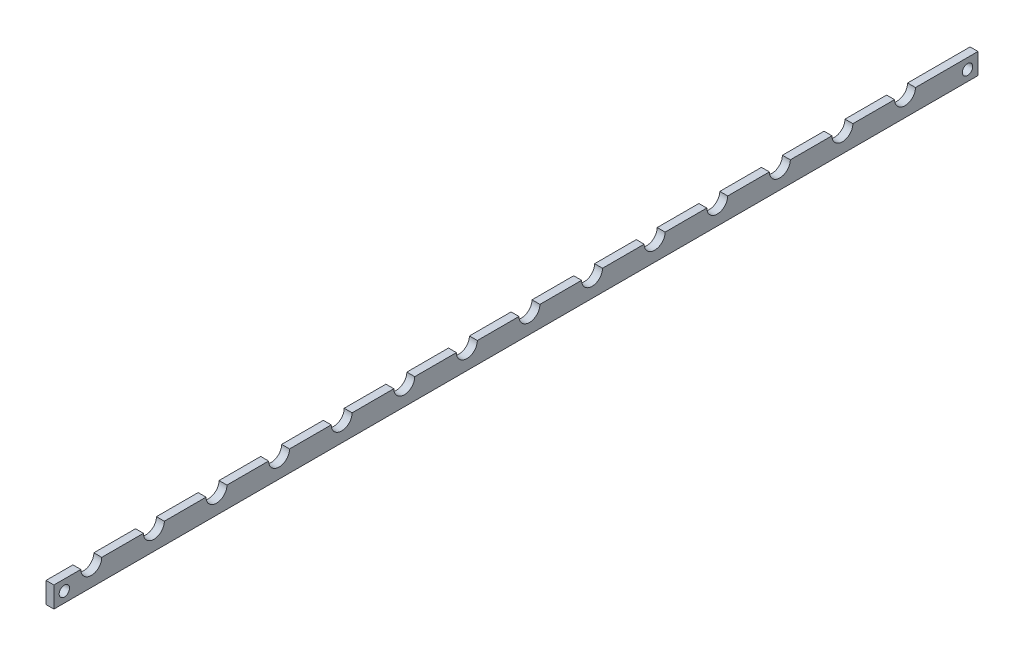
ISO-10303-21;
HEADER;
FILE_DESCRIPTION(('STEP AP214'),'2;1');
FILE_NAME('part.step','',(''),(''),'','','');
FILE_SCHEMA(('AUTOMOTIVE_DESIGN { 1 0 10303 214 1 1 1 1 }'));
ENDSEC;
DATA;
#1=APPLICATION_CONTEXT('core data for automotive mechanical design processes');
#2=APPLICATION_PROTOCOL_DEFINITION('international standard','automotive_design',2000,#1);
#3=PRODUCT_CONTEXT('',#1,'mechanical');
#4=PRODUCT('Part','Part','',(#3));
#5=PRODUCT_RELATED_PRODUCT_CATEGORY('part','',(#4));
#6=PRODUCT_DEFINITION_FORMATION('','',#4);
#7=PRODUCT_DEFINITION_CONTEXT('part definition',#1,'design');
#8=PRODUCT_DEFINITION('design','',#6,#7);
#9=PRODUCT_DEFINITION_SHAPE('','',#8);
#10=(LENGTH_UNIT() NAMED_UNIT(*) SI_UNIT(.MILLI.,.METRE.));
#11=(NAMED_UNIT(*) PLANE_ANGLE_UNIT() SI_UNIT($,.RADIAN.));
#12=(NAMED_UNIT(*) SI_UNIT($,.STERADIAN.) SOLID_ANGLE_UNIT());
#13=UNCERTAINTY_MEASURE_WITH_UNIT(LENGTH_MEASURE(1.E-05),#10,'distance_accuracy_value','');
#14=(GEOMETRIC_REPRESENTATION_CONTEXT(3) GLOBAL_UNCERTAINTY_ASSIGNED_CONTEXT((#13)) GLOBAL_UNIT_ASSIGNED_CONTEXT((#10,
#11,#12)) REPRESENTATION_CONTEXT('',''));
#15=CARTESIAN_POINT('',(0.,0.,0.));
#16=DIRECTION('',(0.,0.,1.));
#17=DIRECTION('',(1.,0.,0.));
#18=AXIS2_PLACEMENT_3D('',#15,#16,#17);
#19=CARTESIAN_POINT('',(4.8,0.,0.));
#20=DIRECTION('',(0.,-1.,0.));
#21=DIRECTION('',(0.,0.,-1.));
#22=AXIS2_PLACEMENT_3D('',#19,#20,#21);
#23=PLANE('',#22);
#24=DIRECTION('',(0.,0.,1.));
#25=VECTOR('',#24,1.);
#26=CARTESIAN_POINT('',(0.,0.,0.));
#27=LINE('',#26,#25);
#28=CARTESIAN_POINT('',(0.,0.,-54.3500000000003));
#29=VERTEX_POINT('',#28);
#30=CARTESIAN_POINT('',(0.,0.,-29.0500000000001));
#31=VERTEX_POINT('',#30);
#32=EDGE_CURVE('E261',#29,#31,#27,.T.);
#33=ORIENTED_EDGE('',*,*,#32,.T.);
#34=DIRECTION('',(1.,0.,0.));
#35=VECTOR('',#34,1.);
#36=CARTESIAN_POINT('',(0.,0.,-29.0500000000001));
#37=LINE('',#36,#35);
#38=CARTESIAN_POINT('',(4.8,0.,-29.0500000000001));
#39=VERTEX_POINT('',#38);
#40=EDGE_CURVE('E50',#31,#39,#37,.T.);
#41=ORIENTED_EDGE('',*,*,#40,.T.);
#42=DIRECTION('',(0.,0.,1.));
#43=VECTOR('',#42,1.);
#44=CARTESIAN_POINT('',(4.8,0.,0.));
#45=LINE('',#44,#43);
#46=CARTESIAN_POINT('',(4.8,0.,-54.3500000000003));
#47=VERTEX_POINT('',#46);
#48=EDGE_CURVE('E411',#47,#39,#45,.T.);
#49=ORIENTED_EDGE('',*,*,#48,.F.);
#50=DIRECTION('',(1.,0.,0.));
#51=VECTOR('',#50,1.);
#52=CARTESIAN_POINT('',(0.,0.,-54.3500000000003));
#53=LINE('',#52,#51);
#54=EDGE_CURVE('E491',#47,#29,#53,.F.);
#55=ORIENTED_EDGE('',*,*,#54,.T.);
#56=EDGE_LOOP('',(#33,#41,#49,#55));
#57=FACE_BOUND('',#56,.T.);
#58=ADVANCED_FACE('F35',(#57),#23,.F.);
#59=CARTESIAN_POINT('',(0.,0.,-92.3500000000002));
#60=VERTEX_POINT('',#59);
#61=CARTESIAN_POINT('',(0.,0.,-67.0500000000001));
#62=VERTEX_POINT('',#61);
#63=EDGE_CURVE('E265',#60,#62,#27,.T.);
#64=ORIENTED_EDGE('',*,*,#63,.T.);
#65=DIRECTION('',(1.,0.,0.));
#66=VECTOR('',#65,1.);
#67=CARTESIAN_POINT('',(0.,0.,-67.0500000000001));
#68=LINE('',#67,#66);
#69=CARTESIAN_POINT('',(4.8,0.,-67.0500000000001));
#70=VERTEX_POINT('',#69);
#71=EDGE_CURVE('E57',#62,#70,#68,.T.);
#72=ORIENTED_EDGE('',*,*,#71,.T.);
#73=CARTESIAN_POINT('',(4.8,0.,-92.3500000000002));
#74=VERTEX_POINT('',#73);
#75=EDGE_CURVE('E414',#74,#70,#45,.T.);
#76=ORIENTED_EDGE('',*,*,#75,.F.);
#77=DIRECTION('',(1.,0.,0.));
#78=VECTOR('',#77,1.);
#79=CARTESIAN_POINT('',(0.,0.,-92.3500000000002));
#80=LINE('',#79,#78);
#81=EDGE_CURVE('E351',#74,#60,#80,.F.);
#82=ORIENTED_EDGE('',*,*,#81,.T.);
#83=EDGE_LOOP('',(#64,#72,#76,#82));
#84=FACE_BOUND('',#83,.T.);
#85=ADVANCED_FACE('F348',(#84),#23,.F.);
#86=CARTESIAN_POINT('',(0.,0.,-130.35));
#87=VERTEX_POINT('',#86);
#88=CARTESIAN_POINT('',(0.,0.,-105.05));
#89=VERTEX_POINT('',#88);
#90=EDGE_CURVE('E334',#87,#89,#27,.T.);
#91=ORIENTED_EDGE('',*,*,#90,.T.);
#92=DIRECTION('',(1.,0.,0.));
#93=VECTOR('',#92,1.);
#94=CARTESIAN_POINT('',(0.,0.,-105.05));
#95=LINE('',#94,#93);
#96=CARTESIAN_POINT('',(4.8,0.,-105.05));
#97=VERTEX_POINT('',#96);
#98=EDGE_CURVE('E485',#89,#97,#95,.T.);
#99=ORIENTED_EDGE('',*,*,#98,.T.);
#100=CARTESIAN_POINT('',(4.8,0.,-130.35));
#101=VERTEX_POINT('',#100);
#102=EDGE_CURVE('E530',#101,#97,#45,.T.);
#103=ORIENTED_EDGE('',*,*,#102,.F.);
#104=DIRECTION('',(1.,0.,0.));
#105=VECTOR('',#104,1.);
#106=CARTESIAN_POINT('',(0.,0.,-130.35));
#107=LINE('',#106,#105);
#108=EDGE_CURVE('E481',#101,#87,#107,.F.);
#109=ORIENTED_EDGE('',*,*,#108,.T.);
#110=EDGE_LOOP('',(#91,#99,#103,#109));
#111=FACE_BOUND('',#110,.T.);
#112=ADVANCED_FACE('F591',(#111),#23,.F.);
#113=CARTESIAN_POINT('',(0.,0.,-168.35));
#114=VERTEX_POINT('',#113);
#115=CARTESIAN_POINT('',(0.,0.,-143.05));
#116=VERTEX_POINT('',#115);
#117=EDGE_CURVE('E328',#114,#116,#27,.T.);
#118=ORIENTED_EDGE('',*,*,#117,.T.);
#119=DIRECTION('',(1.,0.,0.));
#120=VECTOR('',#119,1.);
#121=CARTESIAN_POINT('',(0.,0.,-143.05));
#122=LINE('',#121,#120);
#123=CARTESIAN_POINT('',(4.8,0.,-143.05));
#124=VERTEX_POINT('',#123);
#125=EDGE_CURVE('E479',#116,#124,#122,.T.);
#126=ORIENTED_EDGE('',*,*,#125,.T.);
#127=CARTESIAN_POINT('',(4.8,0.,-168.35));
#128=VERTEX_POINT('',#127);
#129=EDGE_CURVE('E531',#128,#124,#45,.T.);
#130=ORIENTED_EDGE('',*,*,#129,.F.);
#131=DIRECTION('',(1.,0.,0.));
#132=VECTOR('',#131,1.);
#133=CARTESIAN_POINT('',(0.,0.,-168.35));
#134=LINE('',#133,#132);
#135=EDGE_CURVE('E475',#128,#114,#134,.F.);
#136=ORIENTED_EDGE('',*,*,#135,.T.);
#137=EDGE_LOOP('',(#118,#126,#130,#136));
#138=FACE_BOUND('',#137,.T.);
#139=ADVANCED_FACE('F588',(#138),#23,.F.);
#140=CARTESIAN_POINT('',(0.,0.,-206.35));
#141=VERTEX_POINT('',#140);
#142=CARTESIAN_POINT('',(0.,0.,-181.05));
#143=VERTEX_POINT('',#142);
#144=EDGE_CURVE('E322',#141,#143,#27,.T.);
#145=ORIENTED_EDGE('',*,*,#144,.T.);
#146=DIRECTION('',(1.,0.,0.));
#147=VECTOR('',#146,1.);
#148=CARTESIAN_POINT('',(0.,0.,-181.05));
#149=LINE('',#148,#147);
#150=CARTESIAN_POINT('',(4.8,0.,-181.05));
#151=VERTEX_POINT('',#150);
#152=EDGE_CURVE('E473',#143,#151,#149,.T.);
#153=ORIENTED_EDGE('',*,*,#152,.T.);
#154=CARTESIAN_POINT('',(4.8,0.,-206.35));
#155=VERTEX_POINT('',#154);
#156=EDGE_CURVE('E535',#155,#151,#45,.T.);
#157=ORIENTED_EDGE('',*,*,#156,.F.);
#158=DIRECTION('',(1.,0.,0.));
#159=VECTOR('',#158,1.);
#160=CARTESIAN_POINT('',(0.,0.,-206.35));
#161=LINE('',#160,#159);
#162=EDGE_CURVE('E469',#155,#141,#161,.F.);
#163=ORIENTED_EDGE('',*,*,#162,.T.);
#164=EDGE_LOOP('',(#145,#153,#157,#163));
#165=FACE_BOUND('',#164,.T.);
#166=ADVANCED_FACE('F647',(#165),#23,.F.);
#167=CARTESIAN_POINT('',(0.,0.,-244.35));
#168=VERTEX_POINT('',#167);
#169=CARTESIAN_POINT('',(0.,0.,-219.05));
#170=VERTEX_POINT('',#169);
#171=EDGE_CURVE('E316',#168,#170,#27,.T.);
#172=ORIENTED_EDGE('',*,*,#171,.T.);
#173=DIRECTION('',(1.,0.,0.));
#174=VECTOR('',#173,1.);
#175=CARTESIAN_POINT('',(0.,0.,-219.05));
#176=LINE('',#175,#174);
#177=CARTESIAN_POINT('',(4.8,0.,-219.05));
#178=VERTEX_POINT('',#177);
#179=EDGE_CURVE('E467',#170,#178,#176,.T.);
#180=ORIENTED_EDGE('',*,*,#179,.T.);
#181=CARTESIAN_POINT('',(4.8,0.,-244.35));
#182=VERTEX_POINT('',#181);
#183=EDGE_CURVE('E539',#182,#178,#45,.T.);
#184=ORIENTED_EDGE('',*,*,#183,.F.);
#185=DIRECTION('',(1.,0.,0.));
#186=VECTOR('',#185,1.);
#187=CARTESIAN_POINT('',(0.,0.,-244.35));
#188=LINE('',#187,#186);
#189=EDGE_CURVE('E463',#182,#168,#188,.F.);
#190=ORIENTED_EDGE('',*,*,#189,.T.);
#191=EDGE_LOOP('',(#172,#180,#184,#190));
#192=FACE_BOUND('',#191,.T.);
#193=ADVANCED_FACE('F583',(#192),#23,.F.);
#194=CARTESIAN_POINT('',(0.,0.,-282.35));
#195=VERTEX_POINT('',#194);
#196=CARTESIAN_POINT('',(0.,0.,-257.05));
#197=VERTEX_POINT('',#196);
#198=EDGE_CURVE('E310',#195,#197,#27,.T.);
#199=ORIENTED_EDGE('',*,*,#198,.T.);
#200=DIRECTION('',(1.,0.,0.));
#201=VECTOR('',#200,1.);
#202=CARTESIAN_POINT('',(0.,0.,-257.05));
#203=LINE('',#202,#201);
#204=CARTESIAN_POINT('',(4.8,0.,-257.05));
#205=VERTEX_POINT('',#204);
#206=EDGE_CURVE('E461',#197,#205,#203,.T.);
#207=ORIENTED_EDGE('',*,*,#206,.T.);
#208=CARTESIAN_POINT('',(4.8,0.,-282.35));
#209=VERTEX_POINT('',#208);
#210=EDGE_CURVE('E543',#209,#205,#45,.T.);
#211=ORIENTED_EDGE('',*,*,#210,.F.);
#212=DIRECTION('',(1.,0.,0.));
#213=VECTOR('',#212,1.);
#214=CARTESIAN_POINT('',(0.,0.,-282.35));
#215=LINE('',#214,#213);
#216=EDGE_CURVE('E457',#209,#195,#215,.F.);
#217=ORIENTED_EDGE('',*,*,#216,.T.);
#218=EDGE_LOOP('',(#199,#207,#211,#217));
#219=FACE_BOUND('',#218,.T.);
#220=ADVANCED_FACE('F640',(#219),#23,.F.);
#221=CARTESIAN_POINT('',(0.,0.,-320.35));
#222=VERTEX_POINT('',#221);
#223=CARTESIAN_POINT('',(0.,0.,-295.05));
#224=VERTEX_POINT('',#223);
#225=EDGE_CURVE('E304',#222,#224,#27,.T.);
#226=ORIENTED_EDGE('',*,*,#225,.T.);
#227=DIRECTION('',(1.,0.,0.));
#228=VECTOR('',#227,1.);
#229=CARTESIAN_POINT('',(0.,0.,-295.05));
#230=LINE('',#229,#228);
#231=CARTESIAN_POINT('',(4.8,0.,-295.05));
#232=VERTEX_POINT('',#231);
#233=EDGE_CURVE('E455',#224,#232,#230,.T.);
#234=ORIENTED_EDGE('',*,*,#233,.T.);
#235=CARTESIAN_POINT('',(4.8,0.,-320.35));
#236=VERTEX_POINT('',#235);
#237=EDGE_CURVE('E547',#236,#232,#45,.T.);
#238=ORIENTED_EDGE('',*,*,#237,.F.);
#239=DIRECTION('',(1.,0.,0.));
#240=VECTOR('',#239,1.);
#241=CARTESIAN_POINT('',(0.,0.,-320.35));
#242=LINE('',#241,#240);
#243=EDGE_CURVE('E451',#236,#222,#242,.F.);
#244=ORIENTED_EDGE('',*,*,#243,.T.);
#245=EDGE_LOOP('',(#226,#234,#238,#244));
#246=FACE_BOUND('',#245,.T.);
#247=ADVANCED_FACE('F578',(#246),#23,.F.);
#248=CARTESIAN_POINT('',(0.,0.,-358.35));
#249=VERTEX_POINT('',#248);
#250=CARTESIAN_POINT('',(0.,0.,-333.05));
#251=VERTEX_POINT('',#250);
#252=EDGE_CURVE('E298',#249,#251,#27,.T.);
#253=ORIENTED_EDGE('',*,*,#252,.T.);
#254=DIRECTION('',(1.,0.,0.));
#255=VECTOR('',#254,1.);
#256=CARTESIAN_POINT('',(0.,0.,-333.05));
#257=LINE('',#256,#255);
#258=CARTESIAN_POINT('',(4.8,0.,-333.05));
#259=VERTEX_POINT('',#258);
#260=EDGE_CURVE('E449',#251,#259,#257,.T.);
#261=ORIENTED_EDGE('',*,*,#260,.T.);
#262=CARTESIAN_POINT('',(4.8,0.,-358.35));
#263=VERTEX_POINT('',#262);
#264=EDGE_CURVE('E551',#263,#259,#45,.T.);
#265=ORIENTED_EDGE('',*,*,#264,.F.);
#266=DIRECTION('',(1.,0.,0.));
#267=VECTOR('',#266,1.);
#268=CARTESIAN_POINT('',(0.,0.,-358.35));
#269=LINE('',#268,#267);
#270=EDGE_CURVE('E445',#263,#249,#269,.F.);
#271=ORIENTED_EDGE('',*,*,#270,.T.);
#272=EDGE_LOOP('',(#253,#261,#265,#271));
#273=FACE_BOUND('',#272,.T.);
#274=ADVANCED_FACE('F633',(#273),#23,.F.);
#275=CARTESIAN_POINT('',(0.,0.,-396.35));
#276=VERTEX_POINT('',#275);
#277=CARTESIAN_POINT('',(0.,0.,-371.05));
#278=VERTEX_POINT('',#277);
#279=EDGE_CURVE('E292',#276,#278,#27,.T.);
#280=ORIENTED_EDGE('',*,*,#279,.T.);
#281=DIRECTION('',(1.,0.,0.));
#282=VECTOR('',#281,1.);
#283=CARTESIAN_POINT('',(0.,0.,-371.05));
#284=LINE('',#283,#282);
#285=CARTESIAN_POINT('',(4.8,0.,-371.05));
#286=VERTEX_POINT('',#285);
#287=EDGE_CURVE('E443',#278,#286,#284,.T.);
#288=ORIENTED_EDGE('',*,*,#287,.T.);
#289=CARTESIAN_POINT('',(4.8,0.,-396.35));
#290=VERTEX_POINT('',#289);
#291=EDGE_CURVE('E555',#290,#286,#45,.T.);
#292=ORIENTED_EDGE('',*,*,#291,.F.);
#293=DIRECTION('',(1.,0.,0.));
#294=VECTOR('',#293,1.);
#295=CARTESIAN_POINT('',(0.,0.,-396.35));
#296=LINE('',#295,#294);
#297=EDGE_CURVE('E439',#290,#276,#296,.F.);
#298=ORIENTED_EDGE('',*,*,#297,.T.);
#299=EDGE_LOOP('',(#280,#288,#292,#298));
#300=FACE_BOUND('',#299,.T.);
#301=ADVANCED_FACE('F573',(#300),#23,.F.);
#302=CARTESIAN_POINT('',(0.,0.,-434.35));
#303=VERTEX_POINT('',#302);
#304=CARTESIAN_POINT('',(0.,0.,-409.05));
#305=VERTEX_POINT('',#304);
#306=EDGE_CURVE('E286',#303,#305,#27,.T.);
#307=ORIENTED_EDGE('',*,*,#306,.T.);
#308=DIRECTION('',(1.,0.,0.));
#309=VECTOR('',#308,1.);
#310=CARTESIAN_POINT('',(0.,0.,-409.05));
#311=LINE('',#310,#309);
#312=CARTESIAN_POINT('',(4.8,0.,-409.05));
#313=VERTEX_POINT('',#312);
#314=EDGE_CURVE('E437',#305,#313,#311,.T.);
#315=ORIENTED_EDGE('',*,*,#314,.T.);
#316=CARTESIAN_POINT('',(4.8,0.,-434.35));
#317=VERTEX_POINT('',#316);
#318=EDGE_CURVE('E559',#317,#313,#45,.T.);
#319=ORIENTED_EDGE('',*,*,#318,.F.);
#320=DIRECTION('',(1.,0.,0.));
#321=VECTOR('',#320,1.);
#322=CARTESIAN_POINT('',(0.,0.,-434.35));
#323=LINE('',#322,#321);
#324=EDGE_CURVE('E433',#317,#303,#323,.F.);
#325=ORIENTED_EDGE('',*,*,#324,.T.);
#326=EDGE_LOOP('',(#307,#315,#319,#325));
#327=FACE_BOUND('',#326,.T.);
#328=ADVANCED_FACE('F626',(#327),#23,.F.);
#329=CARTESIAN_POINT('',(0.,0.,-472.35));
#330=VERTEX_POINT('',#329);
#331=CARTESIAN_POINT('',(0.,0.,-447.05));
#332=VERTEX_POINT('',#331);
#333=EDGE_CURVE('E280',#330,#332,#27,.T.);
#334=ORIENTED_EDGE('',*,*,#333,.T.);
#335=DIRECTION('',(1.,0.,0.));
#336=VECTOR('',#335,1.);
#337=CARTESIAN_POINT('',(0.,0.,-447.05));
#338=LINE('',#337,#336);
#339=CARTESIAN_POINT('',(4.8,0.,-447.05));
#340=VERTEX_POINT('',#339);
#341=EDGE_CURVE('E431',#332,#340,#338,.T.);
#342=ORIENTED_EDGE('',*,*,#341,.T.);
#343=CARTESIAN_POINT('',(4.8,0.,-472.35));
#344=VERTEX_POINT('',#343);
#345=EDGE_CURVE('E408',#344,#340,#45,.T.);
#346=ORIENTED_EDGE('',*,*,#345,.F.);
#347=DIRECTION('',(1.,0.,0.));
#348=VECTOR('',#347,1.);
#349=CARTESIAN_POINT('',(0.,0.,-472.35));
#350=LINE('',#349,#348);
#351=EDGE_CURVE('E427',#344,#330,#350,.F.);
#352=ORIENTED_EDGE('',*,*,#351,.T.);
#353=EDGE_LOOP('',(#334,#342,#346,#352));
#354=FACE_BOUND('',#353,.T.);
#355=ADVANCED_FACE('F568',(#354),#23,.F.);
#356=CARTESIAN_POINT('',(0.,0.,-510.35));
#357=VERTEX_POINT('',#356);
#358=CARTESIAN_POINT('',(0.,0.,-485.05));
#359=VERTEX_POINT('',#358);
#360=EDGE_CURVE('E271',#357,#359,#27,.T.);
#361=ORIENTED_EDGE('',*,*,#360,.T.);
#362=DIRECTION('',(1.,0.,0.));
#363=VECTOR('',#362,1.);
#364=CARTESIAN_POINT('',(0.,0.,-485.05));
#365=LINE('',#364,#363);
#366=CARTESIAN_POINT('',(4.8,0.,-485.05));
#367=VERTEX_POINT('',#366);
#368=EDGE_CURVE('E425',#359,#367,#365,.T.);
#369=ORIENTED_EDGE('',*,*,#368,.T.);
#370=CARTESIAN_POINT('',(4.8,0.,-510.35));
#371=VERTEX_POINT('',#370);
#372=EDGE_CURVE('E402',#371,#367,#45,.T.);
#373=ORIENTED_EDGE('',*,*,#372,.F.);
#374=DIRECTION('',(1.,0.,0.));
#375=VECTOR('',#374,1.);
#376=CARTESIAN_POINT('',(0.,0.,-510.35));
#377=LINE('',#376,#375);
#378=EDGE_CURVE('E421',#371,#357,#377,.F.);
#379=ORIENTED_EDGE('',*,*,#378,.T.);
#380=EDGE_LOOP('',(#361,#369,#373,#379));
#381=FACE_BOUND('',#380,.T.);
#382=ADVANCED_FACE('F618',(#381),#23,.F.);
#383=CARTESIAN_POINT('',(0.,0.,-561.));
#384=VERTEX_POINT('',#383);
#385=CARTESIAN_POINT('',(0.,0.,-523.05));
#386=VERTEX_POINT('',#385);
#387=EDGE_CURVE('E264',#384,#386,#27,.T.);
#388=ORIENTED_EDGE('',*,*,#387,.T.);
#389=DIRECTION('',(1.,0.,0.));
#390=VECTOR('',#389,1.);
#391=CARTESIAN_POINT('',(0.,0.,-523.05));
#392=LINE('',#391,#390);
#393=CARTESIAN_POINT('',(4.8,0.,-523.05));
#394=VERTEX_POINT('',#393);
#395=EDGE_CURVE('E419',#386,#394,#392,.T.);
#396=ORIENTED_EDGE('',*,*,#395,.T.);
#397=CARTESIAN_POINT('',(4.8,0.,-561.));
#398=VERTEX_POINT('',#397);
#399=EDGE_CURVE('E398',#398,#394,#45,.T.);
#400=ORIENTED_EDGE('',*,*,#399,.F.);
#401=DIRECTION('',(-1.,0.,0.));
#402=VECTOR('',#401,1.);
#403=CARTESIAN_POINT('',(4.8,0.,-561.));
#404=LINE('',#403,#402);
#405=EDGE_CURVE('E396',#398,#384,#404,.T.);
#406=ORIENTED_EDGE('',*,*,#405,.T.);
#407=EDGE_LOOP('',(#388,#396,#400,#406));
#408=FACE_BOUND('',#407,.T.);
#409=ADVANCED_FACE('F611',(#408),#23,.F.);
#410=CARTESIAN_POINT('',(4.8,0.,0.));
#411=DIRECTION('',(0.,0.,-1.));
#412=DIRECTION('',(0.,1.,0.));
#413=AXIS2_PLACEMENT_3D('',#410,#411,#412);
#414=PLANE('',#413);
#415=DIRECTION('',(0.,-1.,0.));
#416=VECTOR('',#415,1.);
#417=CARTESIAN_POINT('',(0.,0.,0.));
#418=LINE('',#417,#416);
#419=CARTESIAN_POINT('',(0.,0.,0.));
#420=VERTEX_POINT('',#419);
#421=CARTESIAN_POINT('',(0.,-12.7,0.));
#422=VERTEX_POINT('',#421);
#423=EDGE_CURVE('E260',#420,#422,#418,.T.);
#424=ORIENTED_EDGE('',*,*,#423,.T.);
#425=DIRECTION('',(-1.,0.,0.));
#426=VECTOR('',#425,1.);
#427=CARTESIAN_POINT('',(4.8,-12.7,0.));
#428=LINE('',#427,#426);
#429=CARTESIAN_POINT('',(4.8,-12.7,0.));
#430=VERTEX_POINT('',#429);
#431=EDGE_CURVE('E390',#430,#422,#428,.T.);
#432=ORIENTED_EDGE('',*,*,#431,.F.);
#433=DIRECTION('',(0.,-1.,0.));
#434=VECTOR('',#433,1.);
#435=CARTESIAN_POINT('',(4.8,0.,0.));
#436=LINE('',#435,#434);
#437=CARTESIAN_POINT('',(4.8,0.,0.));
#438=VERTEX_POINT('',#437);
#439=EDGE_CURVE('E270',#438,#430,#436,.T.);
#440=ORIENTED_EDGE('',*,*,#439,.F.);
#441=DIRECTION('',(-1.,0.,0.));
#442=VECTOR('',#441,1.);
#443=CARTESIAN_POINT('',(4.8,0.,0.));
#444=LINE('',#443,#442);
#445=EDGE_CURVE('E397',#438,#420,#444,.T.);
#446=ORIENTED_EDGE('',*,*,#445,.T.);
#447=EDGE_LOOP('',(#424,#432,#440,#446));
#448=FACE_BOUND('',#447,.T.);
#449=ADVANCED_FACE('F37',(#448),#414,.F.);
#450=CARTESIAN_POINT('',(4.8,-12.7,0.));
#451=DIRECTION('',(0.,1.,0.));
#452=DIRECTION('',(0.,0.,1.));
#453=AXIS2_PLACEMENT_3D('',#450,#451,#452);
#454=PLANE('',#453);
#455=DIRECTION('',(0.,0.,-1.));
#456=VECTOR('',#455,1.);
#457=CARTESIAN_POINT('',(0.,-12.7,0.));
#458=LINE('',#457,#456);
#459=CARTESIAN_POINT('',(0.,-12.7,-561.));
#460=VERTEX_POINT('',#459);
#461=EDGE_CURVE('E266',#422,#460,#458,.T.);
#462=ORIENTED_EDGE('',*,*,#461,.T.);
#463=DIRECTION('',(-1.,0.,0.));
#464=VECTOR('',#463,1.);
#465=CARTESIAN_POINT('',(4.8,-12.7,-561.));
#466=LINE('',#465,#464);
#467=CARTESIAN_POINT('',(4.8,-12.7,-561.));
#468=VERTEX_POINT('',#467);
#469=EDGE_CURVE('E393',#468,#460,#466,.T.);
#470=ORIENTED_EDGE('',*,*,#469,.F.);
#471=DIRECTION('',(0.,0.,-1.));
#472=VECTOR('',#471,1.);
#473=CARTESIAN_POINT('',(4.8,-12.7,0.));
#474=LINE('',#473,#472);
#475=EDGE_CURVE('E277',#430,#468,#474,.T.);
#476=ORIENTED_EDGE('',*,*,#475,.F.);
#477=ORIENTED_EDGE('',*,*,#431,.T.);
#478=EDGE_LOOP('',(#462,#470,#476,#477));
#479=FACE_BOUND('',#478,.T.);
#480=ADVANCED_FACE('F615',(#479),#454,.F.);
#481=CARTESIAN_POINT('',(4.8,0.,-561.));
#482=DIRECTION('',(0.,0.,1.));
#483=DIRECTION('',(0.,-1.,0.));
#484=AXIS2_PLACEMENT_3D('',#481,#482,#483);
#485=PLANE('',#484);
#486=DIRECTION('',(0.,1.,0.));
#487=VECTOR('',#486,1.);
#488=CARTESIAN_POINT('',(0.,0.,-561.));
#489=LINE('',#488,#487);
#490=EDGE_CURVE('E262',#460,#384,#489,.T.);
#491=ORIENTED_EDGE('',*,*,#490,.T.);
#492=ORIENTED_EDGE('',*,*,#405,.F.);
#493=DIRECTION('',(0.,1.,0.));
#494=VECTOR('',#493,1.);
#495=CARTESIAN_POINT('',(4.8,0.,-561.));
#496=LINE('',#495,#494);
#497=EDGE_CURVE('E412',#468,#398,#496,.T.);
#498=ORIENTED_EDGE('',*,*,#497,.F.);
#499=ORIENTED_EDGE('',*,*,#469,.T.);
#500=EDGE_LOOP('',(#491,#492,#498,#499));
#501=FACE_BOUND('',#500,.T.);
#502=ADVANCED_FACE('F610',(#501),#485,.F.);
#503=CARTESIAN_POINT('',(4.8,0.,-16.3500000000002));
#504=VERTEX_POINT('',#503);
#505=EDGE_CURVE('E254',#504,#438,#45,.T.);
#506=ORIENTED_EDGE('',*,*,#505,.F.);
#507=DIRECTION('',(1.,0.,0.));
#508=VECTOR('',#507,1.);
#509=CARTESIAN_POINT('',(0.,0.,-16.3500000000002));
#510=LINE('',#509,#508);
#511=CARTESIAN_POINT('',(0.,0.,-16.3500000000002));
#512=VERTEX_POINT('',#511);
#513=EDGE_CURVE('E242',#504,#512,#510,.F.);
#514=ORIENTED_EDGE('',*,*,#513,.T.);
#515=EDGE_CURVE('E252',#512,#420,#27,.T.);
#516=ORIENTED_EDGE('',*,*,#515,.T.);
#517=ORIENTED_EDGE('',*,*,#445,.F.);
#518=EDGE_LOOP('',(#506,#514,#516,#517));
#519=FACE_BOUND('',#518,.T.);
#520=ADVANCED_FACE('F250',(#519),#23,.F.);
#521=CARTESIAN_POINT('',(4.8,-12.7,0.));
#522=DIRECTION('',(1.,0.,0.));
#523=DIRECTION('',(0.,0.,-1.));
#524=AXIS2_PLACEMENT_3D('',#521,#522,#523);
#525=PLANE('',#524);
#526=CARTESIAN_POINT('',(4.8,-6.35,-6.35));
#527=DIRECTION('',(1.,0.,0.));
#528=DIRECTION('',(0.,0.,-1.));
#529=AXIS2_PLACEMENT_3D('',#526,#527,#528);
#530=CIRCLE('',#529,3.15);
#531=CARTESIAN_POINT('',(4.8,-6.35,-9.5));
#532=VERTEX_POINT('',#531);
#533=EDGE_CURVE('E504',#532,#532,#530,.T.);
#534=ORIENTED_EDGE('',*,*,#533,.F.);
#535=EDGE_LOOP('',(#534));
#536=FACE_BOUND('',#535,.T.);
#537=CARTESIAN_POINT('',(4.8,-6.35,-554.65));
#538=DIRECTION('',(1.,0.,0.));
#539=DIRECTION('',(0.,0.,-1.));
#540=AXIS2_PLACEMENT_3D('',#537,#538,#539);
#541=CIRCLE('',#540,3.15000000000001);
#542=CARTESIAN_POINT('',(4.8,-6.35,-557.8));
#543=VERTEX_POINT('',#542);
#544=EDGE_CURVE('E498',#543,#543,#541,.T.);
#545=ORIENTED_EDGE('',*,*,#544,.F.);
#546=EDGE_LOOP('',(#545));
#547=FACE_BOUND('',#546,.T.);
#548=CARTESIAN_POINT('',(4.8,0.,-22.7000000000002));
#549=DIRECTION('',(1.,0.,0.));
#550=DIRECTION('',(0.,0.,-1.));
#551=AXIS2_PLACEMENT_3D('',#548,#549,#550);
#552=CIRCLE('',#551,6.34999999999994);
#553=EDGE_CURVE('E255',#504,#39,#552,.T.);
#554=ORIENTED_EDGE('',*,*,#553,.F.);
#555=ORIENTED_EDGE('',*,*,#505,.T.);
#556=ORIENTED_EDGE('',*,*,#439,.T.);
#557=ORIENTED_EDGE('',*,*,#475,.T.);
#558=ORIENTED_EDGE('',*,*,#497,.T.);
#559=ORIENTED_EDGE('',*,*,#399,.T.);
#560=CARTESIAN_POINT('',(4.8,0.,-516.7));
#561=DIRECTION('',(1.,0.,0.));
#562=DIRECTION('',(0.,0.,-1.));
#563=AXIS2_PLACEMENT_3D('',#560,#561,#562);
#564=CIRCLE('',#563,6.34999999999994);
#565=EDGE_CURVE('E423',#371,#394,#564,.T.);
#566=ORIENTED_EDGE('',*,*,#565,.F.);
#567=ORIENTED_EDGE('',*,*,#372,.T.);
#568=CARTESIAN_POINT('',(4.8,0.,-478.7));
#569=DIRECTION('',(1.,0.,0.));
#570=DIRECTION('',(0.,0.,-1.));
#571=AXIS2_PLACEMENT_3D('',#568,#569,#570);
#572=CIRCLE('',#571,6.34999999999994);
#573=EDGE_CURVE('E429',#344,#367,#572,.T.);
#574=ORIENTED_EDGE('',*,*,#573,.F.);
#575=ORIENTED_EDGE('',*,*,#345,.T.);
#576=CARTESIAN_POINT('',(4.8,0.,-440.7));
#577=DIRECTION('',(1.,0.,0.));
#578=DIRECTION('',(0.,0.,-1.));
#579=AXIS2_PLACEMENT_3D('',#576,#577,#578);
#580=CIRCLE('',#579,6.34999999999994);
#581=EDGE_CURVE('E435',#317,#340,#580,.T.);
#582=ORIENTED_EDGE('',*,*,#581,.F.);
#583=ORIENTED_EDGE('',*,*,#318,.T.);
#584=CARTESIAN_POINT('',(4.8,0.,-402.7));
#585=DIRECTION('',(1.,0.,0.));
#586=DIRECTION('',(0.,0.,-1.));
#587=AXIS2_PLACEMENT_3D('',#584,#585,#586);
#588=CIRCLE('',#587,6.34999999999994);
#589=EDGE_CURVE('E441',#290,#313,#588,.T.);
#590=ORIENTED_EDGE('',*,*,#589,.F.);
#591=ORIENTED_EDGE('',*,*,#291,.T.);
#592=CARTESIAN_POINT('',(4.8,0.,-364.7));
#593=DIRECTION('',(1.,0.,0.));
#594=DIRECTION('',(0.,0.,-1.));
#595=AXIS2_PLACEMENT_3D('',#592,#593,#594);
#596=CIRCLE('',#595,6.34999999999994);
#597=EDGE_CURVE('E447',#263,#286,#596,.T.);
#598=ORIENTED_EDGE('',*,*,#597,.F.);
#599=ORIENTED_EDGE('',*,*,#264,.T.);
#600=CARTESIAN_POINT('',(4.8,0.,-326.7));
#601=DIRECTION('',(1.,0.,0.));
#602=DIRECTION('',(0.,0.,-1.));
#603=AXIS2_PLACEMENT_3D('',#600,#601,#602);
#604=CIRCLE('',#603,6.34999999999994);
#605=EDGE_CURVE('E453',#236,#259,#604,.T.);
#606=ORIENTED_EDGE('',*,*,#605,.F.);
#607=ORIENTED_EDGE('',*,*,#237,.T.);
#608=CARTESIAN_POINT('',(4.8,0.,-288.7));
#609=DIRECTION('',(1.,0.,0.));
#610=DIRECTION('',(0.,0.,-1.));
#611=AXIS2_PLACEMENT_3D('',#608,#609,#610);
#612=CIRCLE('',#611,6.34999999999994);
#613=EDGE_CURVE('E459',#209,#232,#612,.T.);
#614=ORIENTED_EDGE('',*,*,#613,.F.);
#615=ORIENTED_EDGE('',*,*,#210,.T.);
#616=CARTESIAN_POINT('',(4.8,0.,-250.7));
#617=DIRECTION('',(1.,0.,0.));
#618=DIRECTION('',(0.,0.,-1.));
#619=AXIS2_PLACEMENT_3D('',#616,#617,#618);
#620=CIRCLE('',#619,6.34999999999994);
#621=EDGE_CURVE('E465',#182,#205,#620,.T.);
#622=ORIENTED_EDGE('',*,*,#621,.F.);
#623=ORIENTED_EDGE('',*,*,#183,.T.);
#624=CARTESIAN_POINT('',(4.8,0.,-212.7));
#625=DIRECTION('',(1.,0.,0.));
#626=DIRECTION('',(0.,0.,-1.));
#627=AXIS2_PLACEMENT_3D('',#624,#625,#626);
#628=CIRCLE('',#627,6.34999999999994);
#629=EDGE_CURVE('E471',#155,#178,#628,.T.);
#630=ORIENTED_EDGE('',*,*,#629,.F.);
#631=ORIENTED_EDGE('',*,*,#156,.T.);
#632=CARTESIAN_POINT('',(4.8,0.,-174.7));
#633=DIRECTION('',(1.,0.,0.));
#634=DIRECTION('',(0.,0.,-1.));
#635=AXIS2_PLACEMENT_3D('',#632,#633,#634);
#636=CIRCLE('',#635,6.34999999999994);
#637=EDGE_CURVE('E477',#128,#151,#636,.T.);
#638=ORIENTED_EDGE('',*,*,#637,.F.);
#639=ORIENTED_EDGE('',*,*,#129,.T.);
#640=CARTESIAN_POINT('',(4.8,0.,-136.7));
#641=DIRECTION('',(1.,0.,0.));
#642=DIRECTION('',(0.,0.,-1.));
#643=AXIS2_PLACEMENT_3D('',#640,#641,#642);
#644=CIRCLE('',#643,6.34999999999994);
#645=EDGE_CURVE('E483',#101,#124,#644,.T.);
#646=ORIENTED_EDGE('',*,*,#645,.F.);
#647=ORIENTED_EDGE('',*,*,#102,.T.);
#648=CARTESIAN_POINT('',(4.8,0.,-98.7000000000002));
#649=DIRECTION('',(1.,0.,0.));
#650=DIRECTION('',(0.,0.,-1.));
#651=AXIS2_PLACEMENT_3D('',#648,#649,#650);
#652=CIRCLE('',#651,6.34999999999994);
#653=EDGE_CURVE('E488',#74,#97,#652,.T.);
#654=ORIENTED_EDGE('',*,*,#653,.F.);
#655=ORIENTED_EDGE('',*,*,#75,.T.);
#656=CARTESIAN_POINT('',(4.8,0.,-60.7000000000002));
#657=DIRECTION('',(1.,0.,0.));
#658=DIRECTION('',(0.,0.,-1.));
#659=AXIS2_PLACEMENT_3D('',#656,#657,#658);
#660=CIRCLE('',#659,6.34999999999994);
#661=EDGE_CURVE('E493',#47,#70,#660,.T.);
#662=ORIENTED_EDGE('',*,*,#661,.F.);
#663=ORIENTED_EDGE('',*,*,#48,.T.);
#664=EDGE_LOOP('',(#554,#555,#556,#557,#558,#559,#566,#567,#574,#575,#582,#583,#590,#591,#598,
#599,#606,#607,#614,#615,#622,#623,#630,#631,#638,#639,#646,#647,#654,#655,#662,#663));
#665=FACE_BOUND('',#664,.T.);
#666=ADVANCED_FACE('F519',(#536,#547,#665),#525,.T.);
#667=CARTESIAN_POINT('',(0.,-12.7,0.));
#668=DIRECTION('',(1.,0.,0.));
#669=DIRECTION('',(0.,0.,-1.));
#670=AXIS2_PLACEMENT_3D('',#667,#668,#669);
#671=PLANE('',#670);
#672=CARTESIAN_POINT('',(0.,-6.35,-6.35));
#673=DIRECTION('',(1.,0.,0.));
#674=DIRECTION('',(0.,0.,-1.));
#675=AXIS2_PLACEMENT_3D('',#672,#673,#674);
#676=CIRCLE('',#675,3.15);
#677=CARTESIAN_POINT('',(0.,-6.35,-9.5));
#678=VERTEX_POINT('',#677);
#679=EDGE_CURVE('E501',#678,#678,#676,.T.);
#680=ORIENTED_EDGE('',*,*,#679,.T.);
#681=EDGE_LOOP('',(#680));
#682=FACE_BOUND('',#681,.T.);
#683=CARTESIAN_POINT('',(0.,-6.35,-554.65));
#684=DIRECTION('',(1.,0.,0.));
#685=DIRECTION('',(0.,0.,-1.));
#686=AXIS2_PLACEMENT_3D('',#683,#684,#685);
#687=CIRCLE('',#686,3.15000000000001);
#688=CARTESIAN_POINT('',(0.,-6.35,-557.8));
#689=VERTEX_POINT('',#688);
#690=EDGE_CURVE('E497',#689,#689,#687,.T.);
#691=ORIENTED_EDGE('',*,*,#690,.T.);
#692=EDGE_LOOP('',(#691));
#693=FACE_BOUND('',#692,.T.);
#694=ORIENTED_EDGE('',*,*,#515,.F.);
#695=CARTESIAN_POINT('',(0.,0.,-22.7000000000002));
#696=DIRECTION('',(1.,0.,0.));
#697=DIRECTION('',(0.,0.,-1.));
#698=AXIS2_PLACEMENT_3D('',#695,#696,#697);
#699=CIRCLE('',#698,6.34999999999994);
#700=EDGE_CURVE('E11',#512,#31,#699,.T.);
#701=ORIENTED_EDGE('',*,*,#700,.T.);
#702=ORIENTED_EDGE('',*,*,#32,.F.);
#703=CARTESIAN_POINT('',(0.,0.,-60.7000000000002));
#704=DIRECTION('',(1.,0.,0.));
#705=DIRECTION('',(0.,0.,-1.));
#706=AXIS2_PLACEMENT_3D('',#703,#704,#705);
#707=CIRCLE('',#706,6.34999999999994);
#708=EDGE_CURVE('E43',#29,#62,#707,.T.);
#709=ORIENTED_EDGE('',*,*,#708,.T.);
#710=ORIENTED_EDGE('',*,*,#63,.F.);
#711=CARTESIAN_POINT('',(0.,0.,-98.7000000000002));
#712=DIRECTION('',(1.,0.,0.));
#713=DIRECTION('',(0.,0.,-1.));
#714=AXIS2_PLACEMENT_3D('',#711,#712,#713);
#715=CIRCLE('',#714,6.34999999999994);
#716=EDGE_CURVE('E353',#60,#89,#715,.T.);
#717=ORIENTED_EDGE('',*,*,#716,.T.);
#718=ORIENTED_EDGE('',*,*,#90,.F.);
#719=CARTESIAN_POINT('',(0.,0.,-136.7));
#720=DIRECTION('',(1.,0.,0.));
#721=DIRECTION('',(0.,0.,-1.));
#722=AXIS2_PLACEMENT_3D('',#719,#720,#721);
#723=CIRCLE('',#722,6.34999999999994);
#724=EDGE_CURVE('E355',#87,#116,#723,.T.);
#725=ORIENTED_EDGE('',*,*,#724,.T.);
#726=ORIENTED_EDGE('',*,*,#117,.F.);
#727=CARTESIAN_POINT('',(0.,0.,-174.7));
#728=DIRECTION('',(1.,0.,0.));
#729=DIRECTION('',(0.,0.,-1.));
#730=AXIS2_PLACEMENT_3D('',#727,#728,#729);
#731=CIRCLE('',#730,6.34999999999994);
#732=EDGE_CURVE('E360',#114,#143,#731,.T.);
#733=ORIENTED_EDGE('',*,*,#732,.T.);
#734=ORIENTED_EDGE('',*,*,#144,.F.);
#735=CARTESIAN_POINT('',(0.,0.,-212.7));
#736=DIRECTION('',(1.,0.,0.));
#737=DIRECTION('',(0.,0.,-1.));
#738=AXIS2_PLACEMENT_3D('',#735,#736,#737);
#739=CIRCLE('',#738,6.34999999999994);
#740=EDGE_CURVE('E363',#141,#170,#739,.T.);
#741=ORIENTED_EDGE('',*,*,#740,.T.);
#742=ORIENTED_EDGE('',*,*,#171,.F.);
#743=CARTESIAN_POINT('',(0.,0.,-250.7));
#744=DIRECTION('',(1.,0.,0.));
#745=DIRECTION('',(0.,0.,-1.));
#746=AXIS2_PLACEMENT_3D('',#743,#744,#745);
#747=CIRCLE('',#746,6.34999999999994);
#748=EDGE_CURVE('E366',#168,#197,#747,.T.);
#749=ORIENTED_EDGE('',*,*,#748,.T.);
#750=ORIENTED_EDGE('',*,*,#198,.F.);
#751=CARTESIAN_POINT('',(0.,0.,-288.7));
#752=DIRECTION('',(1.,0.,0.));
#753=DIRECTION('',(0.,0.,-1.));
#754=AXIS2_PLACEMENT_3D('',#751,#752,#753);
#755=CIRCLE('',#754,6.34999999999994);
#756=EDGE_CURVE('E369',#195,#224,#755,.T.);
#757=ORIENTED_EDGE('',*,*,#756,.T.);
#758=ORIENTED_EDGE('',*,*,#225,.F.);
#759=CARTESIAN_POINT('',(0.,0.,-326.7));
#760=DIRECTION('',(1.,0.,0.));
#761=DIRECTION('',(0.,0.,-1.));
#762=AXIS2_PLACEMENT_3D('',#759,#760,#761);
#763=CIRCLE('',#762,6.34999999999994);
#764=EDGE_CURVE('E372',#222,#251,#763,.T.);
#765=ORIENTED_EDGE('',*,*,#764,.T.);
#766=ORIENTED_EDGE('',*,*,#252,.F.);
#767=CARTESIAN_POINT('',(0.,0.,-364.7));
#768=DIRECTION('',(1.,0.,0.));
#769=DIRECTION('',(0.,0.,-1.));
#770=AXIS2_PLACEMENT_3D('',#767,#768,#769);
#771=CIRCLE('',#770,6.34999999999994);
#772=EDGE_CURVE('E375',#249,#278,#771,.T.);
#773=ORIENTED_EDGE('',*,*,#772,.T.);
#774=ORIENTED_EDGE('',*,*,#279,.F.);
#775=CARTESIAN_POINT('',(0.,0.,-402.7));
#776=DIRECTION('',(1.,0.,0.));
#777=DIRECTION('',(0.,0.,-1.));
#778=AXIS2_PLACEMENT_3D('',#775,#776,#777);
#779=CIRCLE('',#778,6.34999999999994);
#780=EDGE_CURVE('E378',#276,#305,#779,.T.);
#781=ORIENTED_EDGE('',*,*,#780,.T.);
#782=ORIENTED_EDGE('',*,*,#306,.F.);
#783=CARTESIAN_POINT('',(0.,0.,-440.7));
#784=DIRECTION('',(1.,0.,0.));
#785=DIRECTION('',(0.,0.,-1.));
#786=AXIS2_PLACEMENT_3D('',#783,#784,#785);
#787=CIRCLE('',#786,6.34999999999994);
#788=EDGE_CURVE('E381',#303,#332,#787,.T.);
#789=ORIENTED_EDGE('',*,*,#788,.T.);
#790=ORIENTED_EDGE('',*,*,#333,.F.);
#791=CARTESIAN_POINT('',(0.,0.,-478.7));
#792=DIRECTION('',(1.,0.,0.));
#793=DIRECTION('',(0.,0.,-1.));
#794=AXIS2_PLACEMENT_3D('',#791,#792,#793);
#795=CIRCLE('',#794,6.34999999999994);
#796=EDGE_CURVE('E384',#330,#359,#795,.T.);
#797=ORIENTED_EDGE('',*,*,#796,.T.);
#798=ORIENTED_EDGE('',*,*,#360,.F.);
#799=CARTESIAN_POINT('',(0.,0.,-516.7));
#800=DIRECTION('',(1.,0.,0.));
#801=DIRECTION('',(0.,0.,-1.));
#802=AXIS2_PLACEMENT_3D('',#799,#800,#801);
#803=CIRCLE('',#802,6.34999999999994);
#804=EDGE_CURVE('E387',#357,#386,#803,.T.);
#805=ORIENTED_EDGE('',*,*,#804,.T.);
#806=ORIENTED_EDGE('',*,*,#387,.F.);
#807=ORIENTED_EDGE('',*,*,#490,.F.);
#808=ORIENTED_EDGE('',*,*,#461,.F.);
#809=ORIENTED_EDGE('',*,*,#423,.F.);
#810=EDGE_LOOP('',(#694,#701,#702,#709,#710,#717,#718,#725,#726,#733,#734,#741,#742,#749,#750,
#757,#758,#765,#766,#773,#774,#781,#782,#789,#790,#797,#798,#805,#806,#807,#808,#809));
#811=FACE_BOUND('',#810,.T.);
#812=ADVANCED_FACE('F258',(#682,#693,#811),#671,.F.);
#813=CARTESIAN_POINT('',(0.,0.,-516.7));
#814=DIRECTION('',(1.,0.,0.));
#815=DIRECTION('',(0.,0.,-1.));
#816=AXIS2_PLACEMENT_3D('',#813,#814,#815);
#817=CYLINDRICAL_SURFACE('',#816,6.34999999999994);
#818=ORIENTED_EDGE('',*,*,#804,.F.);
#819=ORIENTED_EDGE('',*,*,#378,.F.);
#820=ORIENTED_EDGE('',*,*,#565,.T.);
#821=ORIENTED_EDGE('',*,*,#395,.F.);
#822=EDGE_LOOP('',(#818,#819,#820,#821));
#823=FACE_BOUND('',#822,.T.);
#824=ADVANCED_FACE('F673',(#823),#817,.F.);
#825=CARTESIAN_POINT('',(0.,0.,-478.7));
#826=DIRECTION('',(1.,0.,0.));
#827=DIRECTION('',(0.,0.,-1.));
#828=AXIS2_PLACEMENT_3D('',#825,#826,#827);
#829=CYLINDRICAL_SURFACE('',#828,6.34999999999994);
#830=ORIENTED_EDGE('',*,*,#796,.F.);
#831=ORIENTED_EDGE('',*,*,#351,.F.);
#832=ORIENTED_EDGE('',*,*,#573,.T.);
#833=ORIENTED_EDGE('',*,*,#368,.F.);
#834=EDGE_LOOP('',(#830,#831,#832,#833));
#835=FACE_BOUND('',#834,.T.);
#836=ADVANCED_FACE('F677',(#835),#829,.F.);
#837=CARTESIAN_POINT('',(0.,0.,-440.7));
#838=DIRECTION('',(1.,0.,0.));
#839=DIRECTION('',(0.,0.,-1.));
#840=AXIS2_PLACEMENT_3D('',#837,#838,#839);
#841=CYLINDRICAL_SURFACE('',#840,6.34999999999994);
#842=ORIENTED_EDGE('',*,*,#788,.F.);
#843=ORIENTED_EDGE('',*,*,#324,.F.);
#844=ORIENTED_EDGE('',*,*,#581,.T.);
#845=ORIENTED_EDGE('',*,*,#341,.F.);
#846=EDGE_LOOP('',(#842,#843,#844,#845));
#847=FACE_BOUND('',#846,.T.);
#848=ADVANCED_FACE('F570',(#847),#841,.F.);
#849=CARTESIAN_POINT('',(0.,0.,-402.7));
#850=DIRECTION('',(1.,0.,0.));
#851=DIRECTION('',(0.,0.,-1.));
#852=AXIS2_PLACEMENT_3D('',#849,#850,#851);
#853=CYLINDRICAL_SURFACE('',#852,6.34999999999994);
#854=ORIENTED_EDGE('',*,*,#780,.F.);
#855=ORIENTED_EDGE('',*,*,#297,.F.);
#856=ORIENTED_EDGE('',*,*,#589,.T.);
#857=ORIENTED_EDGE('',*,*,#314,.F.);
#858=EDGE_LOOP('',(#854,#855,#856,#857));
#859=FACE_BOUND('',#858,.T.);
#860=ADVANCED_FACE('F572',(#859),#853,.F.);
#861=CARTESIAN_POINT('',(0.,0.,-364.7));
#862=DIRECTION('',(1.,0.,0.));
#863=DIRECTION('',(0.,0.,-1.));
#864=AXIS2_PLACEMENT_3D('',#861,#862,#863);
#865=CYLINDRICAL_SURFACE('',#864,6.34999999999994);
#866=ORIENTED_EDGE('',*,*,#772,.F.);
#867=ORIENTED_EDGE('',*,*,#270,.F.);
#868=ORIENTED_EDGE('',*,*,#597,.T.);
#869=ORIENTED_EDGE('',*,*,#287,.F.);
#870=EDGE_LOOP('',(#866,#867,#868,#869));
#871=FACE_BOUND('',#870,.T.);
#872=ADVANCED_FACE('F575',(#871),#865,.F.);
#873=CARTESIAN_POINT('',(0.,0.,-326.7));
#874=DIRECTION('',(1.,0.,0.));
#875=DIRECTION('',(0.,0.,-1.));
#876=AXIS2_PLACEMENT_3D('',#873,#874,#875);
#877=CYLINDRICAL_SURFACE('',#876,6.34999999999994);
#878=ORIENTED_EDGE('',*,*,#764,.F.);
#879=ORIENTED_EDGE('',*,*,#243,.F.);
#880=ORIENTED_EDGE('',*,*,#605,.T.);
#881=ORIENTED_EDGE('',*,*,#260,.F.);
#882=EDGE_LOOP('',(#878,#879,#880,#881));
#883=FACE_BOUND('',#882,.T.);
#884=ADVANCED_FACE('F577',(#883),#877,.F.);
#885=CARTESIAN_POINT('',(0.,0.,-288.7));
#886=DIRECTION('',(1.,0.,0.));
#887=DIRECTION('',(0.,0.,-1.));
#888=AXIS2_PLACEMENT_3D('',#885,#886,#887);
#889=CYLINDRICAL_SURFACE('',#888,6.34999999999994);
#890=ORIENTED_EDGE('',*,*,#756,.F.);
#891=ORIENTED_EDGE('',*,*,#216,.F.);
#892=ORIENTED_EDGE('',*,*,#613,.T.);
#893=ORIENTED_EDGE('',*,*,#233,.F.);
#894=EDGE_LOOP('',(#890,#891,#892,#893));
#895=FACE_BOUND('',#894,.T.);
#896=ADVANCED_FACE('F580',(#895),#889,.F.);
#897=CARTESIAN_POINT('',(0.,0.,-250.7));
#898=DIRECTION('',(1.,0.,0.));
#899=DIRECTION('',(0.,0.,-1.));
#900=AXIS2_PLACEMENT_3D('',#897,#898,#899);
#901=CYLINDRICAL_SURFACE('',#900,6.34999999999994);
#902=ORIENTED_EDGE('',*,*,#748,.F.);
#903=ORIENTED_EDGE('',*,*,#189,.F.);
#904=ORIENTED_EDGE('',*,*,#621,.T.);
#905=ORIENTED_EDGE('',*,*,#206,.F.);
#906=EDGE_LOOP('',(#902,#903,#904,#905));
#907=FACE_BOUND('',#906,.T.);
#908=ADVANCED_FACE('F582',(#907),#901,.F.);
#909=CARTESIAN_POINT('',(0.,0.,-212.7));
#910=DIRECTION('',(1.,0.,0.));
#911=DIRECTION('',(0.,0.,-1.));
#912=AXIS2_PLACEMENT_3D('',#909,#910,#911);
#913=CYLINDRICAL_SURFACE('',#912,6.34999999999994);
#914=ORIENTED_EDGE('',*,*,#740,.F.);
#915=ORIENTED_EDGE('',*,*,#162,.F.);
#916=ORIENTED_EDGE('',*,*,#629,.T.);
#917=ORIENTED_EDGE('',*,*,#179,.F.);
#918=EDGE_LOOP('',(#914,#915,#916,#917));
#919=FACE_BOUND('',#918,.T.);
#920=ADVANCED_FACE('F585',(#919),#913,.F.);
#921=CARTESIAN_POINT('',(0.,0.,-174.7));
#922=DIRECTION('',(1.,0.,0.));
#923=DIRECTION('',(0.,0.,-1.));
#924=AXIS2_PLACEMENT_3D('',#921,#922,#923);
#925=CYLINDRICAL_SURFACE('',#924,6.34999999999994);
#926=ORIENTED_EDGE('',*,*,#732,.F.);
#927=ORIENTED_EDGE('',*,*,#135,.F.);
#928=ORIENTED_EDGE('',*,*,#637,.T.);
#929=ORIENTED_EDGE('',*,*,#152,.F.);
#930=EDGE_LOOP('',(#926,#927,#928,#929));
#931=FACE_BOUND('',#930,.T.);
#932=ADVANCED_FACE('F587',(#931),#925,.F.);
#933=CARTESIAN_POINT('',(0.,0.,-136.7));
#934=DIRECTION('',(1.,0.,0.));
#935=DIRECTION('',(0.,0.,-1.));
#936=AXIS2_PLACEMENT_3D('',#933,#934,#935);
#937=CYLINDRICAL_SURFACE('',#936,6.34999999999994);
#938=ORIENTED_EDGE('',*,*,#724,.F.);
#939=ORIENTED_EDGE('',*,*,#108,.F.);
#940=ORIENTED_EDGE('',*,*,#645,.T.);
#941=ORIENTED_EDGE('',*,*,#125,.F.);
#942=EDGE_LOOP('',(#938,#939,#940,#941));
#943=FACE_BOUND('',#942,.T.);
#944=ADVANCED_FACE('F590',(#943),#937,.F.);
#945=CARTESIAN_POINT('',(0.,0.,-98.7000000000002));
#946=DIRECTION('',(1.,0.,0.));
#947=DIRECTION('',(0.,0.,-1.));
#948=AXIS2_PLACEMENT_3D('',#945,#946,#947);
#949=CYLINDRICAL_SURFACE('',#948,6.34999999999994);
#950=ORIENTED_EDGE('',*,*,#716,.F.);
#951=ORIENTED_EDGE('',*,*,#81,.F.);
#952=ORIENTED_EDGE('',*,*,#653,.T.);
#953=ORIENTED_EDGE('',*,*,#98,.F.);
#954=EDGE_LOOP('',(#950,#951,#952,#953));
#955=FACE_BOUND('',#954,.T.);
#956=ADVANCED_FACE('F593',(#955),#949,.F.);
#957=CARTESIAN_POINT('',(0.,0.,-60.7000000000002));
#958=DIRECTION('',(1.,0.,0.));
#959=DIRECTION('',(0.,0.,-1.));
#960=AXIS2_PLACEMENT_3D('',#957,#958,#959);
#961=CYLINDRICAL_SURFACE('',#960,6.34999999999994);
#962=ORIENTED_EDGE('',*,*,#708,.F.);
#963=ORIENTED_EDGE('',*,*,#54,.F.);
#964=ORIENTED_EDGE('',*,*,#661,.T.);
#965=ORIENTED_EDGE('',*,*,#71,.F.);
#966=EDGE_LOOP('',(#962,#963,#964,#965));
#967=FACE_BOUND('',#966,.T.);
#968=ADVANCED_FACE('F527',(#967),#961,.F.);
#969=CARTESIAN_POINT('',(0.,0.,-22.7000000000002));
#970=DIRECTION('',(1.,0.,0.));
#971=DIRECTION('',(0.,0.,-1.));
#972=AXIS2_PLACEMENT_3D('',#969,#970,#971);
#973=CYLINDRICAL_SURFACE('',#972,6.34999999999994);
#974=ORIENTED_EDGE('',*,*,#700,.F.);
#975=ORIENTED_EDGE('',*,*,#513,.F.);
#976=ORIENTED_EDGE('',*,*,#553,.T.);
#977=ORIENTED_EDGE('',*,*,#40,.F.);
#978=EDGE_LOOP('',(#974,#975,#976,#977));
#979=FACE_BOUND('',#978,.T.);
#980=ADVANCED_FACE('F241',(#979),#973,.F.);
#981=CARTESIAN_POINT('',(0.,-6.35,-554.65));
#982=DIRECTION('',(1.,0.,0.));
#983=DIRECTION('',(0.,0.,-1.));
#984=AXIS2_PLACEMENT_3D('',#981,#982,#983);
#985=CYLINDRICAL_SURFACE('',#984,3.15000000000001);
#986=ORIENTED_EDGE('',*,*,#690,.F.);
#987=EDGE_LOOP('',(#986));
#988=FACE_BOUND('',#987,.T.);
#989=ORIENTED_EDGE('',*,*,#544,.T.);
#990=EDGE_LOOP('',(#989));
#991=FACE_BOUND('',#990,.T.);
#992=ADVANCED_FACE('F515',(#988,#991),#985,.F.);
#993=CARTESIAN_POINT('',(0.,-6.35,-6.35));
#994=DIRECTION('',(1.,0.,0.));
#995=DIRECTION('',(0.,0.,-1.));
#996=AXIS2_PLACEMENT_3D('',#993,#994,#995);
#997=CYLINDRICAL_SURFACE('',#996,3.15);
#998=ORIENTED_EDGE('',*,*,#679,.F.);
#999=EDGE_LOOP('',(#998));
#1000=FACE_BOUND('',#999,.T.);
#1001=ORIENTED_EDGE('',*,*,#533,.T.);
#1002=EDGE_LOOP('',(#1001));
#1003=FACE_BOUND('',#1002,.T.);
#1004=ADVANCED_FACE('F512',(#1000,#1003),#997,.F.);
#1005=CLOSED_SHELL('',(#58,#85,#112,#139,#166,#193,#220,#247,#274,#301,#328,#355,#382,#409,#449,
#480,#502,#520,#666,#812,#824,#836,#848,#860,#872,#884,#896,#908,#920,#932,#944,#956,#968,#980,
#992,#1004));
#1006=MANIFOLD_SOLID_BREP('B2',#1005);
#1007=ADVANCED_BREP_SHAPE_REPRESENTATION('',(#18,#1006),#14);
#1008=SHAPE_DEFINITION_REPRESENTATION(#9,#1007);
ENDSEC;
END-ISO-10303-21;
